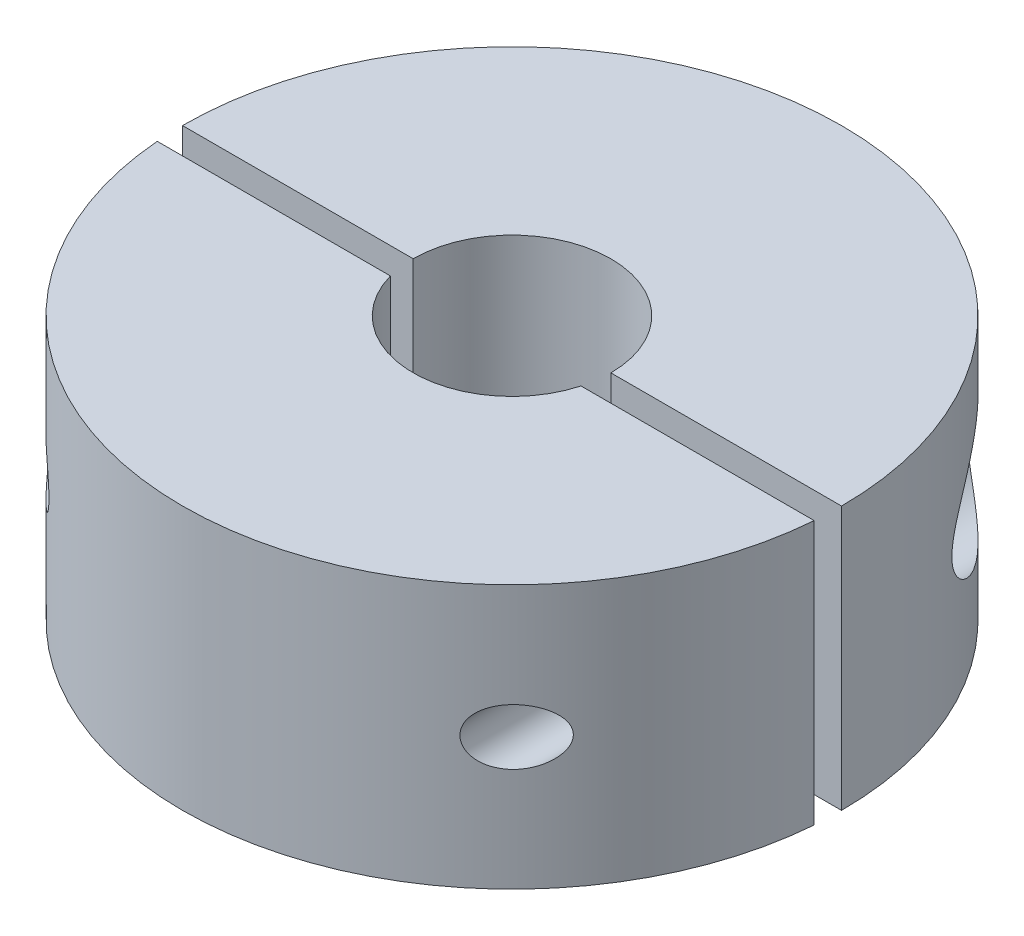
ISO-10303-21;
HEADER;
FILE_DESCRIPTION(('STEP AP214'),'2;1');
FILE_NAME('part.step','',(''),(''),'','','');
FILE_SCHEMA(('AUTOMOTIVE_DESIGN { 1 0 10303 214 1 1 1 1 }'));
ENDSEC;
DATA;
#1=APPLICATION_CONTEXT('core data for automotive mechanical design processes');
#2=APPLICATION_PROTOCOL_DEFINITION('international standard','automotive_design',2000,#1);
#3=PRODUCT_CONTEXT('',#1,'mechanical');
#4=PRODUCT('Part','Part','',(#3));
#5=PRODUCT_RELATED_PRODUCT_CATEGORY('part','',(#4));
#6=PRODUCT_DEFINITION_FORMATION('','',#4);
#7=PRODUCT_DEFINITION_CONTEXT('part definition',#1,'design');
#8=PRODUCT_DEFINITION('design','',#6,#7);
#9=PRODUCT_DEFINITION_SHAPE('','',#8);
#10=(LENGTH_UNIT() NAMED_UNIT(*) SI_UNIT(.MILLI.,.METRE.));
#11=(NAMED_UNIT(*) PLANE_ANGLE_UNIT() SI_UNIT($,.RADIAN.));
#12=(NAMED_UNIT(*) SI_UNIT($,.STERADIAN.) SOLID_ANGLE_UNIT());
#13=UNCERTAINTY_MEASURE_WITH_UNIT(LENGTH_MEASURE(1.E-05),#10,'distance_accuracy_value','');
#14=(GEOMETRIC_REPRESENTATION_CONTEXT(3) GLOBAL_UNCERTAINTY_ASSIGNED_CONTEXT((#13)) GLOBAL_UNIT_ASSIGNED_CONTEXT((#10,
#11,#12)) REPRESENTATION_CONTEXT('',''));
#15=CARTESIAN_POINT('',(0.,0.,0.));
#16=DIRECTION('',(0.,0.,1.));
#17=DIRECTION('',(1.,0.,0.));
#18=AXIS2_PLACEMENT_3D('',#15,#16,#17);
#19=CARTESIAN_POINT('',(0.,12.7,0.));
#20=DIRECTION('',(0.,1.,0.));
#21=DIRECTION('',(0.,0.,1.));
#22=AXIS2_PLACEMENT_3D('',#19,#20,#21);
#23=PLANE('',#22);
#24=DIRECTION('',(1.,0.,0.));
#25=VECTOR('',#24,1.);
#26=CARTESIAN_POINT('',(-21.9078752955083,12.7,1.26662234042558));
#27=LINE('',#26,#25);
#28=CARTESIAN_POINT('',(-15.8243891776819,12.7,1.26662234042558));
#29=VERTEX_POINT('',#28);
#30=CARTESIAN_POINT('',(-4.59097746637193,12.7,1.26662234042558));
#31=VERTEX_POINT('',#30);
#32=EDGE_CURVE('E56',#29,#31,#27,.T.);
#33=ORIENTED_EDGE('',*,*,#32,.F.);
#34=CARTESIAN_POINT('',(0.,12.7,0.));
#35=DIRECTION('',(0.,1.,0.));
#36=DIRECTION('',(0.,0.,1.));
#37=AXIS2_PLACEMENT_3D('',#34,#35,#36);
#38=CIRCLE('',#37,15.875);
#39=CARTESIAN_POINT('',(15.8243891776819,12.7,1.26662234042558));
#40=VERTEX_POINT('',#39);
#41=EDGE_CURVE('E111',#29,#40,#38,.T.);
#42=ORIENTED_EDGE('',*,*,#41,.T.);
#43=CARTESIAN_POINT('',(4.59097746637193,12.7,1.26662234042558));
#44=VERTEX_POINT('',#43);
#45=EDGE_CURVE('E93',#44,#40,#27,.T.);
#46=ORIENTED_EDGE('',*,*,#45,.F.);
#47=CARTESIAN_POINT('',(0.,12.7,0.));
#48=DIRECTION('',(0.,1.,0.));
#49=DIRECTION('',(0.,0.,1.));
#50=AXIS2_PLACEMENT_3D('',#47,#48,#49);
#51=CIRCLE('',#50,4.7625);
#52=EDGE_CURVE('E98',#31,#44,#51,.T.);
#53=ORIENTED_EDGE('',*,*,#52,.F.);
#54=EDGE_LOOP('',(#33,#42,#46,#53));
#55=FACE_BOUND('',#54,.T.);
#56=ADVANCED_FACE('F48',(#55),#23,.T.);
#57=CARTESIAN_POINT('',(0.,0.,0.));
#58=DIRECTION('',(0.,1.,0.));
#59=DIRECTION('',(0.,0.,1.));
#60=AXIS2_PLACEMENT_3D('',#57,#58,#59);
#61=PLANE('',#60);
#62=CARTESIAN_POINT('',(0.,0.,0.));
#63=DIRECTION('',(0.,1.,0.));
#64=DIRECTION('',(0.,0.,1.));
#65=AXIS2_PLACEMENT_3D('',#62,#63,#64);
#66=CIRCLE('',#65,15.875);
#67=CARTESIAN_POINT('',(-15.8243891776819,0.,1.26662234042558));
#68=VERTEX_POINT('',#67);
#69=CARTESIAN_POINT('',(15.8243891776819,0.,1.26662234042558));
#70=VERTEX_POINT('',#69);
#71=EDGE_CURVE('E99',#68,#70,#66,.T.);
#72=ORIENTED_EDGE('',*,*,#71,.F.);
#73=DIRECTION('',(1.,0.,0.));
#74=VECTOR('',#73,1.);
#75=CARTESIAN_POINT('',(-21.9078752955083,0.,1.26662234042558));
#76=LINE('',#75,#74);
#77=CARTESIAN_POINT('',(-4.59097746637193,0.,1.26662234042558));
#78=VERTEX_POINT('',#77);
#79=EDGE_CURVE('E69',#68,#78,#76,.T.);
#80=ORIENTED_EDGE('',*,*,#79,.T.);
#81=CARTESIAN_POINT('',(0.,0.,0.));
#82=DIRECTION('',(0.,1.,0.));
#83=DIRECTION('',(0.,0.,1.));
#84=AXIS2_PLACEMENT_3D('',#81,#82,#83);
#85=CIRCLE('',#84,4.7625);
#86=CARTESIAN_POINT('',(4.59097746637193,0.,1.26662234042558));
#87=VERTEX_POINT('',#86);
#88=EDGE_CURVE('E51',#78,#87,#85,.T.);
#89=ORIENTED_EDGE('',*,*,#88,.T.);
#90=EDGE_CURVE('E88',#87,#70,#76,.T.);
#91=ORIENTED_EDGE('',*,*,#90,.T.);
#92=EDGE_LOOP('',(#72,#80,#89,#91));
#93=FACE_BOUND('',#92,.T.);
#94=ADVANCED_FACE('F104',(#93),#61,.F.);
#95=CARTESIAN_POINT('',(0.,12.7,0.));
#96=DIRECTION('',(0.,-1.,0.));
#97=DIRECTION('',(0.,0.,-1.));
#98=AXIS2_PLACEMENT_3D('',#95,#96,#97);
#99=CYLINDRICAL_SURFACE('',#98,15.875);
#100=CARTESIAN_POINT('',(9.89983917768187,6.35,12.4100285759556));
#101=CARTESIAN_POINT('',(9.89984348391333,6.41360092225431,12.4100256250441));
#102=CARTESIAN_POINT('',(9.90435704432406,6.47724579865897,12.4064286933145));
#103=CARTESIAN_POINT('',(9.92211288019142,6.60253042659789,12.39223236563));
#104=CARTESIAN_POINT('',(9.93536469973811,6.66416790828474,12.3816253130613));
#105=CARTESIAN_POINT('',(9.96965984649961,6.78339226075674,12.3540270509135));
#106=CARTESIAN_POINT('',(9.99066879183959,6.84099569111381,12.3370640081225));
#107=CARTESIAN_POINT('',(10.0393080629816,6.95121470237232,12.2975158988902));
#108=CARTESIAN_POINT('',(10.0669388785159,7.00382991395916,12.2749304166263));
#109=CARTESIAN_POINT('',(10.1295573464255,7.10663612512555,12.2233153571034));
#110=CARTESIAN_POINT('',(10.1649100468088,7.1564382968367,12.1939589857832));
#111=CARTESIAN_POINT('',(10.2402467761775,7.24918635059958,12.1307624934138));
#112=CARTESIAN_POINT('',(10.2802333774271,7.29212839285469,12.0969198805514));
#113=CARTESIAN_POINT('',(10.3848325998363,7.39127205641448,12.0074012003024));
#114=CARTESIAN_POINT('',(10.4516159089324,7.44308940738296,11.9493831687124));
#115=CARTESIAN_POINT('',(10.5895059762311,7.5318338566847,11.8273636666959));
#116=CARTESIAN_POINT('',(10.6606221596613,7.56872705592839,11.763348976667));
#117=CARTESIAN_POINT('',(10.8274234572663,7.63814827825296,11.6102966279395));
#118=CARTESIAN_POINT('',(10.9237935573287,7.66564364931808,11.5197268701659));
#119=CARTESIAN_POINT('',(11.116041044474,7.69920031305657,11.3343360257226));
#120=CARTESIAN_POINT('',(11.2119179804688,7.70524459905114,11.2395116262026));
#121=CARTESIAN_POINT('',(11.4025562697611,7.69763088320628,11.0460904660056));
#122=CARTESIAN_POINT('',(11.4972637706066,7.6836046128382,10.9474563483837));
#123=CARTESIAN_POINT('',(11.6818382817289,7.63610024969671,10.7502792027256));
#124=CARTESIAN_POINT('',(11.7717045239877,7.60261908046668,10.6517361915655));
#125=CARTESIAN_POINT('',(11.9342175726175,7.5212116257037,10.4691538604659));
#126=CARTESIAN_POINT('',(12.0076327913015,7.47552044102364,10.3848011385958));
#127=CARTESIAN_POINT('',(12.1475023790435,7.36781536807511,10.2208278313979));
#128=CARTESIAN_POINT('',(12.2139697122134,7.30583266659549,10.1411985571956));
#129=CARTESIAN_POINT('',(12.313760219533,7.19041543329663,10.0195120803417));
#130=CARTESIAN_POINT('',(12.3501203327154,7.14259355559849,9.97462302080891));
#131=CARTESIAN_POINT('',(12.4178098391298,7.03919923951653,9.89022369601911));
#132=CARTESIAN_POINT('',(12.4491461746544,6.98363769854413,9.85070601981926));
#133=CARTESIAN_POINT('',(12.4983683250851,6.87862371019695,9.78813630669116));
#134=CARTESIAN_POINT('',(12.5176810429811,6.83085480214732,9.7634027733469));
#135=CARTESIAN_POINT('',(12.5512639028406,6.73089675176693,9.72019287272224));
#136=CARTESIAN_POINT('',(12.565541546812,6.67871433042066,9.70170719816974));
#137=CARTESIAN_POINT('',(12.5860990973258,6.57964549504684,9.67501802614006));
#138=CARTESIAN_POINT('',(12.5933005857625,6.53327284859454,9.6656331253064));
#139=CARTESIAN_POINT('',(12.602820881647,6.4391941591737,9.65321681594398));
#140=CARTESIAN_POINT('',(12.6051430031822,6.39148904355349,9.65018109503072));
#141=CARTESIAN_POINT('',(12.6047068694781,6.2960973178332,9.65075073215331));
#142=CARTESIAN_POINT('',(12.6019437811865,6.24841076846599,9.65436240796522));
#143=CARTESIAN_POINT('',(12.5915692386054,6.1544833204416,9.66788905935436));
#144=CARTESIAN_POINT('',(12.5839543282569,6.1082434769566,9.67780852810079));
#145=CARTESIAN_POINT('',(12.5621271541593,6.00763185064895,9.70613066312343));
#146=CARTESIAN_POINT('',(12.5467815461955,5.95391853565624,9.72598350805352));
#147=CARTESIAN_POINT('',(12.5108202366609,5.85128617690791,9.77219827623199));
#148=CARTESIAN_POINT('',(12.4901951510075,5.80237588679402,9.79857178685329));
#149=CARTESIAN_POINT('',(12.4345892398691,5.68862305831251,9.86911444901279));
#150=CARTESIAN_POINT('',(12.3973317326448,5.62656065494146,9.9159413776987));
#151=CARTESIAN_POINT('',(12.3166659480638,5.51237687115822,10.0159631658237));
#152=CARTESIAN_POINT('',(12.2732438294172,5.46027849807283,10.0691723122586));
#153=CARTESIAN_POINT('',(12.1927894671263,5.37657940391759,10.1663410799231));
#154=CARTESIAN_POINT('',(12.1567137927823,5.34305671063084,10.2094681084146));
#155=CARTESIAN_POINT('',(12.0823572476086,5.28093873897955,10.2973584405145));
#156=CARTESIAN_POINT('',(12.0440752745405,5.25234595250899,10.3421225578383));
#157=CARTESIAN_POINT('',(11.9264128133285,5.17355964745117,10.4781015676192));
#158=CARTESIAN_POINT('',(11.8442177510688,5.1303601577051,10.5710007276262));
#159=CARTESIAN_POINT('',(11.6712610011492,5.06044436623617,10.7617155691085));
#160=CARTESIAN_POINT('',(11.5802945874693,5.03439935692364,10.8595857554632));
#161=CARTESIAN_POINT('',(11.3942372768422,5.0016003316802,11.0546421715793));
#162=CARTESIAN_POINT('',(11.2991478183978,4.99483964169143,11.1518286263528));
#163=CARTESIAN_POINT('',(11.1121351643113,5.00167144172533,11.3381013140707));
#164=CARTESIAN_POINT('',(11.0203255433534,5.01416476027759,11.4273390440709));
#165=CARTESIAN_POINT('',(10.8371771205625,5.05931658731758,11.6011667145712));
#166=CARTESIAN_POINT('',(10.7458379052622,5.09195239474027,11.685761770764));
#167=CARTESIAN_POINT('',(10.5900471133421,5.16839685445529,11.8268607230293));
#168=CARTESIAN_POINT('',(10.5246728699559,5.20724227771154,11.8850313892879));
#169=CARTESIAN_POINT('',(10.3984375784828,5.29824349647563,11.9956291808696));
#170=CARTESIAN_POINT('',(10.3375705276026,5.35038116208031,12.0480639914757));
#171=CARTESIAN_POINT('',(10.2351335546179,5.45622496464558,12.1351238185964));
#172=CARTESIAN_POINT('',(10.1921724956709,5.50739103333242,12.1711917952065));
#173=CARTESIAN_POINT('',(10.1128781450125,5.61819986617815,12.2371555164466));
#174=CARTESIAN_POINT('',(10.0765392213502,5.67783534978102,12.267056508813));
#175=CARTESIAN_POINT('',(10.0174013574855,5.79516071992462,12.315378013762));
#176=CARTESIAN_POINT('',(9.99338991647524,5.85180588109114,12.3348469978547));
#177=CARTESIAN_POINT('',(9.95299862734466,5.9694406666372,12.3674622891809));
#178=CARTESIAN_POINT('',(9.93660684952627,6.03042332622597,12.3806184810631));
#179=CARTESIAN_POINT('',(9.9163827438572,6.1347838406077,12.3968174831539));
#180=CARTESIAN_POINT('',(9.91019896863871,6.17743023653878,12.4017583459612));
#181=CARTESIAN_POINT('',(9.90192541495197,6.26337755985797,12.4083651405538));
#182=CARTESIAN_POINT('',(9.89983624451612,6.30667858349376,12.4100305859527));
#183=CARTESIAN_POINT('',(9.89983917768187,6.35,12.4100285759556));
#184=B_SPLINE_CURVE_WITH_KNOTS('',3,(#100,#101,#102,#103,#104,#105,#106,#107,#108,#109,#110,
#111,#112,#113,#114,#115,#116,#117,#118,#119,#120,#121,#122,#123,#124,#125,#126,#127,#128,#129,
#130,#131,#132,#133,#134,#135,#136,#137,#138,#139,#140,#141,#142,#143,#144,#145,#146,#147,#148,
#149,#150,#151,#152,#153,#154,#155,#156,#157,#158,#159,#160,#161,#162,#163,#164,#165,#166,#167,
#168,#169,#170,#171,#172,#173,#174,#175,#176,#177,#178,#179,#180,#181,#182,#183),.UNSPECIFIED.,
.T.,.F.,(4,2,2,2,2,2,2,2,2,2,2,2,2,2,2,2,2,2,2,2,2,2,2,2,2,2,2,2,2,2,2,2,2,2,2,2,2,2,2,2,2,4),
(0.,0.190625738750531,0.381460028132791,0.571458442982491,0.761470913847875,0.964016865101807,
1.16667579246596,1.47254085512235,1.77909681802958,2.18218341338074,2.58558950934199,
2.9964931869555,3.40746185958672,3.76875721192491,4.12936591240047,4.35378200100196,
4.5778852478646,4.74875921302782,4.91937749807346,5.06232265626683,5.2051706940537,
5.34815456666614,5.49124040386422,5.66811780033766,5.84531180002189,6.10252816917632,
6.36033147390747,6.5564581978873,6.75268376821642,7.14514579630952,7.5521742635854,
7.95906184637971,8.34356651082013,8.72763861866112,9.01388269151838,9.29973841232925,
9.52665269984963,9.7533730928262,9.9461599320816,10.1386439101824,10.2684683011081,
10.398311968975),.UNSPECIFIED.);
#185=CARTESIAN_POINT('',(9.89983917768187,6.35,12.4100285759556));
#186=VERTEX_POINT('',#185);
#187=EDGE_CURVE('E207',#186,#186,#184,.T.);
#188=ORIENTED_EDGE('',*,*,#187,.T.);
#189=EDGE_LOOP('',(#188));
#190=FACE_BOUND('',#189,.T.);
#191=CARTESIAN_POINT('',(-12.6049391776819,6.35,9.65044731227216));
#192=CARTESIAN_POINT('',(-12.6049385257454,6.40630066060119,9.65044824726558));
#193=CARTESIAN_POINT('',(-12.6013859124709,6.46260501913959,9.65509369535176));
#194=CARTESIAN_POINT('',(-12.5875964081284,6.57297673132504,9.67306373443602));
#195=CARTESIAN_POINT('',(-12.5773503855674,6.62704092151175,9.6864001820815));
#196=CARTESIAN_POINT('',(-12.5513289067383,6.73076608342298,9.72009299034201));
#197=CARTESIAN_POINT('',(-12.5356131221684,6.78046760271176,9.7403735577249));
#198=CARTESIAN_POINT('',(-12.4997233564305,6.87548302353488,9.78638826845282));
#199=CARTESIAN_POINT('',(-12.4795474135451,6.92079498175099,9.81212481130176));
#200=CARTESIAN_POINT('',(-12.4228742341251,7.03207068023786,9.88387223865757));
#201=CARTESIAN_POINT('',(-12.3837170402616,7.09468331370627,9.93295850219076));
#202=CARTESIAN_POINT('',(-12.2991337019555,7.20955070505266,10.0375041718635));
#203=CARTESIAN_POINT('',(-12.2536894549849,7.26177445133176,10.0929819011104));
#204=CARTESIAN_POINT('',(-12.1698627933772,7.34509442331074,10.1937852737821));
#205=CARTESIAN_POINT('',(-12.1324706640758,7.37823431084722,10.2382763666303));
#206=CARTESIAN_POINT('',(-12.0554737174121,7.43943377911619,10.3288295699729));
#207=CARTESIAN_POINT('',(-12.01586781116,7.46749083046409,10.3748924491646));
#208=CARTESIAN_POINT('',(-11.8942317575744,7.54442510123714,10.5146596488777));
#209=CARTESIAN_POINT('',(-11.8093733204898,7.58607498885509,10.6099545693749));
#210=CARTESIAN_POINT('',(-11.6312499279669,7.65198929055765,10.8049865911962));
#211=CARTESIAN_POINT('',(-11.5377966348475,7.6756097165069,10.9047640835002));
#212=CARTESIAN_POINT('',(-11.3469084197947,7.70267737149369,11.1032520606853));
#213=CARTESIAN_POINT('',(-11.2494754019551,7.706134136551,11.201963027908));
#214=CARTESIAN_POINT('',(-11.0623184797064,7.69208983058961,11.3866740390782));
#215=CARTESIAN_POINT('',(-10.9727546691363,7.67657295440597,11.4729833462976));
#216=CARTESIAN_POINT('',(-10.7945448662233,7.62605860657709,11.6408041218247));
#217=CARTESIAN_POINT('',(-10.7058979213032,7.59108398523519,11.7223210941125));
#218=CARTESIAN_POINT('',(-10.5548385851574,7.51110827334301,11.8582726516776));
#219=CARTESIAN_POINT('',(-10.491426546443,7.47082783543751,11.9143689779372));
#220=CARTESIAN_POINT('',(-10.3693607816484,7.3773945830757,12.0207527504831));
#221=CARTESIAN_POINT('',(-10.3107002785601,7.32426054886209,12.0710485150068));
#222=CARTESIAN_POINT('',(-10.2122044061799,7.2169382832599,12.1544150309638));
#223=CARTESIAN_POINT('',(-10.1709647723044,7.16515318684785,12.188909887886));
#224=CARTESIAN_POINT('',(-10.0952058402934,7.05346506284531,12.2517289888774));
#225=CARTESIAN_POINT('',(-10.0606847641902,6.99356419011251,12.2800548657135));
#226=CARTESIAN_POINT('',(-10.000144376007,6.86603856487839,12.3294074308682));
#227=CARTESIAN_POINT('',(-9.9742028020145,6.79835029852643,12.3503674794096));
#228=CARTESIAN_POINT('',(-9.93327116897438,6.65767614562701,12.3833136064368));
#229=CARTESIAN_POINT('',(-9.91826901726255,6.58469620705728,12.3953095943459));
#230=CARTESIAN_POINT('',(-9.90184139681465,6.44733173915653,12.4084346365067));
#231=CARTESIAN_POINT('',(-9.89873687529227,6.38327124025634,12.4109078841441));
#232=CARTESIAN_POINT('',(-9.901634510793,6.25550001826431,12.4085964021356));
#233=CARTESIAN_POINT('',(-9.90763332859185,6.1917891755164,12.403814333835));
#234=CARTESIAN_POINT('',(-9.92762670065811,6.07088439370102,12.3878165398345));
#235=CARTESIAN_POINT('',(-9.94106913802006,6.01353749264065,12.3770448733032));
#236=CARTESIAN_POINT('',(-9.97476213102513,5.90229479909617,12.3499073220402));
#237=CARTESIAN_POINT('',(-9.99501326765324,5.848399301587,12.3335409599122));
#238=CARTESIAN_POINT('',(-10.0428379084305,5.74171341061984,12.2946344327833));
#239=CARTESIAN_POINT('',(-10.070800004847,5.68921945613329,12.2717636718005));
#240=CARTESIAN_POINT('',(-10.1320491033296,5.58997522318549,12.2212432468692));
#241=CARTESIAN_POINT('',(-10.1653393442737,5.54322846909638,12.1935906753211));
#242=CARTESIAN_POINT('',(-10.2514389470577,5.4367667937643,12.1213851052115));
#243=CARTESIAN_POINT('',(-10.306441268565,5.38025200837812,12.0747118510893));
#244=CARTESIAN_POINT('',(-10.4219406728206,5.27965439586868,11.9751671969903));
#245=CARTESIAN_POINT('',(-10.4824484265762,5.23559642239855,11.922283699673));
#246=CARTESIAN_POINT('',(-10.6264483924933,5.14715961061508,11.7943274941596));
#247=CARTESIAN_POINT('',(-10.711116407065,5.10715986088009,11.717557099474));
#248=CARTESIAN_POINT('',(-10.8822253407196,5.04591074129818,11.5588277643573));
#249=CARTESIAN_POINT('',(-10.968668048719,5.02468134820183,11.4768633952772));
#250=CARTESIAN_POINT('',(-11.1628554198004,4.99600150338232,11.2884409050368));
#251=CARTESIAN_POINT('',(-11.2704201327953,4.99343540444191,11.1810597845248));
#252=CARTESIAN_POINT('',(-11.4815256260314,5.0127801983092,10.9641759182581));
#253=CARTESIAN_POINT('',(-11.5850573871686,5.03474302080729,10.8546691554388));
#254=CARTESIAN_POINT('',(-11.735673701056,5.08561739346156,10.6908935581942));
#255=CARTESIAN_POINT('',(-11.7853290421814,5.10570619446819,10.6361169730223));
#256=CARTESIAN_POINT('',(-11.8826228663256,5.15204211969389,10.5273079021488));
#257=CARTESIAN_POINT('',(-11.9302606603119,5.17829132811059,10.4732756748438));
#258=CARTESIAN_POINT('',(-12.0229421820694,5.23705715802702,10.3667476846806));
#259=CARTESIAN_POINT('',(-12.0679937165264,5.26955347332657,10.3142475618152));
#260=CARTESIAN_POINT('',(-12.1551166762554,5.34121197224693,10.211429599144));
#261=CARTESIAN_POINT('',(-12.1971909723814,5.38036760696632,10.1611096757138));
#262=CARTESIAN_POINT('',(-12.2772547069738,5.46545414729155,10.0642212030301));
#263=CARTESIAN_POINT('',(-12.3152821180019,5.51131025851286,10.0176190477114));
#264=CARTESIAN_POINT('',(-12.3866564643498,5.61069957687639,9.92922858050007));
#265=CARTESIAN_POINT('',(-12.4200090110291,5.66422342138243,9.88743450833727));
#266=CARTESIAN_POINT('',(-12.4744276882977,5.76799620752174,9.81864604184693));
#267=CARTESIAN_POINT('',(-12.4966184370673,5.81678494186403,9.79036082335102));
#268=CARTESIAN_POINT('',(-12.5357799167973,5.91952258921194,9.74016739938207));
#269=CARTESIAN_POINT('',(-12.5527561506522,5.97346598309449,9.71825247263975));
#270=CARTESIAN_POINT('',(-12.5788430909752,6.08046288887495,9.68445925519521));
#271=CARTESIAN_POINT('',(-12.5885389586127,6.13313164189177,9.67183647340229));
#272=CARTESIAN_POINT('',(-12.6015833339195,6.2405342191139,9.65483522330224));
#273=CARTESIAN_POINT('',(-12.6049398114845,6.29526536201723,9.65044640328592));
#274=CARTESIAN_POINT('',(-12.6049391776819,6.35,9.65044731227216));
#275=B_SPLINE_CURVE_WITH_KNOTS('',3,(#191,#192,#193,#194,#195,#196,#197,#198,#199,#200,#201,
#202,#203,#204,#205,#206,#207,#208,#209,#210,#211,#212,#213,#214,#215,#216,#217,#218,#219,#220,
#221,#222,#223,#224,#225,#226,#227,#228,#229,#230,#231,#232,#233,#234,#235,#236,#237,#238,#239,
#240,#241,#242,#243,#244,#245,#246,#247,#248,#249,#250,#251,#252,#253,#254,#255,#256,#257,#258,
#259,#260,#261,#262,#263,#264,#265,#266,#267,#268,#269,#270,#271,#272,#273,#274),.UNSPECIFIED.,
.T.,.F.,(4,2,2,2,2,2,2,2,2,2,2,2,2,2,2,2,2,2,2,2,2,2,2,2,2,2,2,2,2,2,2,2,2,2,2,2,2,2,2,2,2,4),
(0.,0.168629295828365,0.337489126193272,0.504561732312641,0.671707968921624,0.936248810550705,
1.20156785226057,1.40201227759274,1.60255617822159,2.00358969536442,2.41835222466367,
2.83291858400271,3.20760281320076,3.58184795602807,3.86214979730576,4.14204454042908,
4.36512643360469,4.58814921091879,4.81314069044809,5.03788308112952,5.22940513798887,
5.42085695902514,5.5997107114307,5.77857972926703,5.96900667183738,6.15954981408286,
6.43294918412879,6.70689024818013,7.06819939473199,7.42989261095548,7.88367469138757,
8.33841928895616,8.56803855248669,8.79773561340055,9.02669829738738,9.25543710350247,
9.48179411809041,9.70787706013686,9.88906599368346,10.0700630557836,10.2342083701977,
10.3981471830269),.UNSPECIFIED.);
#276=CARTESIAN_POINT('',(-12.6049391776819,6.35,9.65044731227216));
#277=VERTEX_POINT('',#276);
#278=EDGE_CURVE('E119',#277,#277,#275,.T.);
#279=ORIENTED_EDGE('',*,*,#278,.T.);
#280=EDGE_LOOP('',(#279));
#281=FACE_BOUND('',#280,.T.);
#282=ORIENTED_EDGE('',*,*,#41,.F.);
#283=DIRECTION('',(0.,-1.,0.));
#284=VECTOR('',#283,1.);
#285=CARTESIAN_POINT('',(-15.8243891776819,12.7,1.26662234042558));
#286=LINE('',#285,#284);
#287=EDGE_CURVE('E64',#29,#68,#286,.T.);
#288=ORIENTED_EDGE('',*,*,#287,.T.);
#289=ORIENTED_EDGE('',*,*,#71,.T.);
#290=DIRECTION('',(0.,-1.,0.));
#291=VECTOR('',#290,1.);
#292=CARTESIAN_POINT('',(15.8243891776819,12.7,1.26662234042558));
#293=LINE('',#292,#291);
#294=EDGE_CURVE('E91',#70,#40,#293,.F.);
#295=ORIENTED_EDGE('',*,*,#294,.T.);
#296=EDGE_LOOP('',(#282,#288,#289,#295));
#297=FACE_BOUND('',#296,.T.);
#298=ADVANCED_FACE('F107',(#190,#281,#297),#99,.T.);
#299=CARTESIAN_POINT('',(0.,12.7,0.));
#300=DIRECTION('',(0.,-1.,0.));
#301=DIRECTION('',(0.,0.,-1.));
#302=AXIS2_PLACEMENT_3D('',#299,#300,#301);
#303=CYLINDRICAL_SURFACE('',#302,4.7625);
#304=DIRECTION('',(0.,-1.,0.));
#305=VECTOR('',#304,1.);
#306=CARTESIAN_POINT('',(-4.59097746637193,12.7,1.26662234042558));
#307=LINE('',#306,#305);
#308=EDGE_CURVE('E12',#31,#78,#307,.T.);
#309=ORIENTED_EDGE('',*,*,#308,.F.);
#310=ORIENTED_EDGE('',*,*,#52,.T.);
#311=DIRECTION('',(0.,-1.,0.));
#312=VECTOR('',#311,1.);
#313=CARTESIAN_POINT('',(4.59097746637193,12.7,1.26662234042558));
#314=LINE('',#313,#312);
#315=EDGE_CURVE('E83',#87,#44,#314,.F.);
#316=ORIENTED_EDGE('',*,*,#315,.F.);
#317=ORIENTED_EDGE('',*,*,#88,.F.);
#318=EDGE_LOOP('',(#309,#310,#316,#317));
#319=FACE_BOUND('',#318,.T.);
#320=ADVANCED_FACE('F141',(#319),#303,.F.);
#321=CARTESIAN_POINT('',(-21.9078752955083,0.,1.26662234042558));
#322=DIRECTION('',(0.,0.,1.));
#323=DIRECTION('',(1.,0.,0.));
#324=AXIS2_PLACEMENT_3D('',#321,#322,#323);
#325=PLANE('',#324);
#326=CARTESIAN_POINT('',(11.2523891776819,6.35,1.26662234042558));
#327=DIRECTION('',(0.,0.,-1.));
#328=DIRECTION('',(-1.,0.,0.));
#329=AXIS2_PLACEMENT_3D('',#326,#327,#328);
#330=CIRCLE('',#329,1.35255);
#331=CARTESIAN_POINT('',(9.89983917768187,6.35,1.26662234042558));
#332=VERTEX_POINT('',#331);
#333=EDGE_CURVE('E204',#332,#332,#330,.T.);
#334=ORIENTED_EDGE('',*,*,#333,.F.);
#335=EDGE_LOOP('',(#334));
#336=FACE_BOUND('',#335,.T.);
#337=ORIENTED_EDGE('',*,*,#90,.F.);
#338=ORIENTED_EDGE('',*,*,#315,.T.);
#339=ORIENTED_EDGE('',*,*,#45,.T.);
#340=ORIENTED_EDGE('',*,*,#294,.F.);
#341=EDGE_LOOP('',(#337,#338,#339,#340));
#342=FACE_BOUND('',#341,.T.);
#343=ADVANCED_FACE('F92',(#336,#342),#325,.F.);
#344=CARTESIAN_POINT('',(-11.2523891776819,6.35,1.26662234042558));
#345=DIRECTION('',(0.,0.,-1.));
#346=DIRECTION('',(-1.,0.,0.));
#347=AXIS2_PLACEMENT_3D('',#344,#345,#346);
#348=CIRCLE('',#347,1.35255);
#349=CARTESIAN_POINT('',(-12.6049391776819,6.35,1.26662234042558));
#350=VERTEX_POINT('',#349);
#351=EDGE_CURVE('E126',#350,#350,#348,.T.);
#352=ORIENTED_EDGE('',*,*,#351,.F.);
#353=EDGE_LOOP('',(#352));
#354=FACE_BOUND('',#353,.T.);
#355=ORIENTED_EDGE('',*,*,#32,.T.);
#356=ORIENTED_EDGE('',*,*,#308,.T.);
#357=ORIENTED_EDGE('',*,*,#79,.F.);
#358=ORIENTED_EDGE('',*,*,#287,.F.);
#359=EDGE_LOOP('',(#355,#356,#357,#358));
#360=FACE_BOUND('',#359,.T.);
#361=ADVANCED_FACE('F136',(#354,#360),#325,.F.);
#362=CARTESIAN_POINT('',(-11.2523891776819,6.35,1.26662234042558));
#363=DIRECTION('',(0.,0.,-1.));
#364=DIRECTION('',(-1.,0.,0.));
#365=AXIS2_PLACEMENT_3D('',#362,#363,#364);
#366=CYLINDRICAL_SURFACE('',#365,1.35255);
#367=ORIENTED_EDGE('',*,*,#351,.T.);
#368=EDGE_LOOP('',(#367));
#369=FACE_BOUND('',#368,.T.);
#370=ORIENTED_EDGE('',*,*,#278,.F.);
#371=EDGE_LOOP('',(#370));
#372=FACE_BOUND('',#371,.T.);
#373=ADVANCED_FACE('F130',(#369,#372),#366,.F.);
#374=CARTESIAN_POINT('',(11.2523891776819,6.35,1.26662234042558));
#375=DIRECTION('',(0.,0.,-1.));
#376=DIRECTION('',(-1.,0.,0.));
#377=AXIS2_PLACEMENT_3D('',#374,#375,#376);
#378=CYLINDRICAL_SURFACE('',#377,1.35255);
#379=ORIENTED_EDGE('',*,*,#333,.T.);
#380=EDGE_LOOP('',(#379));
#381=FACE_BOUND('',#380,.T.);
#382=ORIENTED_EDGE('',*,*,#187,.F.);
#383=EDGE_LOOP('',(#382));
#384=FACE_BOUND('',#383,.T.);
#385=ADVANCED_FACE('F135',(#381,#384),#378,.F.);
#386=CLOSED_SHELL('',(#56,#94,#298,#320,#343,#361,#373,#385));
#387=MANIFOLD_SOLID_BREP('B2',#386);
#388=CARTESIAN_POINT('',(0.,12.7,0.));
#389=DIRECTION('',(0.,-1.,0.));
#390=DIRECTION('',(0.,0.,-1.));
#391=AXIS2_PLACEMENT_3D('',#388,#389,#390);
#392=CYLINDRICAL_SURFACE('',#391,4.7625);
#393=DIRECTION('',(0.,-1.,0.));
#394=VECTOR('',#393,1.);
#395=CARTESIAN_POINT('',(4.7625,12.7,0.));
#396=LINE('',#395,#394);
#397=CARTESIAN_POINT('',(4.7625,12.7,0.));
#398=VERTEX_POINT('',#397);
#399=CARTESIAN_POINT('',(4.7625,0.,0.));
#400=VERTEX_POINT('',#399);
#401=EDGE_CURVE('E46',#398,#400,#396,.T.);
#402=ORIENTED_EDGE('',*,*,#401,.F.);
#403=CARTESIAN_POINT('',(0.,12.7,0.));
#404=DIRECTION('',(0.,1.,0.));
#405=DIRECTION('',(0.,0.,1.));
#406=AXIS2_PLACEMENT_3D('',#403,#404,#405);
#407=CIRCLE('',#406,4.7625);
#408=CARTESIAN_POINT('',(-4.7625,12.7,0.));
#409=VERTEX_POINT('',#408);
#410=EDGE_CURVE('E301',#398,#409,#407,.T.);
#411=ORIENTED_EDGE('',*,*,#410,.T.);
#412=DIRECTION('',(0.,-1.,0.));
#413=VECTOR('',#412,1.);
#414=CARTESIAN_POINT('',(-4.7625,12.7,0.));
#415=LINE('',#414,#413);
#416=CARTESIAN_POINT('',(-4.7625,0.,0.));
#417=VERTEX_POINT('',#416);
#418=EDGE_CURVE('E252',#417,#409,#415,.F.);
#419=ORIENTED_EDGE('',*,*,#418,.F.);
#420=CARTESIAN_POINT('',(0.,0.,0.));
#421=DIRECTION('',(0.,1.,0.));
#422=DIRECTION('',(0.,0.,1.));
#423=AXIS2_PLACEMENT_3D('',#420,#421,#422);
#424=CIRCLE('',#423,4.7625);
#425=EDGE_CURVE('E291',#400,#417,#424,.T.);
#426=ORIENTED_EDGE('',*,*,#425,.F.);
#427=EDGE_LOOP('',(#402,#411,#419,#426));
#428=FACE_BOUND('',#427,.T.);
#429=ADVANCED_FACE('F239',(#428),#392,.F.);
#430=CARTESIAN_POINT('',(0.,12.7,0.));
#431=DIRECTION('',(0.,-1.,0.));
#432=DIRECTION('',(0.,0.,-1.));
#433=AXIS2_PLACEMENT_3D('',#430,#431,#432);
#434=CYLINDRICAL_SURFACE('',#433,15.875);
#435=CARTESIAN_POINT('',(-8.20438917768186,6.35,-13.590571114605));
#436=CARTESIAN_POINT('',(-8.20439077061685,6.42558126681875,-13.5905704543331));
#437=CARTESIAN_POINT('',(-8.2072070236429,6.5011851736,-13.5888715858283));
#438=CARTESIAN_POINT('',(-8.2184278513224,6.65183862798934,-13.5820875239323));
#439=CARTESIAN_POINT('',(-8.22683581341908,6.72688781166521,-13.5770002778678));
#440=CARTESIAN_POINT('',(-8.26036372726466,6.95066010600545,-13.5566501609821));
#441=CARTESIAN_POINT('',(-8.29378735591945,7.09779658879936,-13.5362989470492));
#442=CARTESIAN_POINT('',(-8.38084132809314,7.38281305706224,-13.4825696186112));
#443=CARTESIAN_POINT('',(-8.43441028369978,7.52071967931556,-13.4492310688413));
#444=CARTESIAN_POINT('',(-8.55906995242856,7.78443080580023,-13.3702418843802));
#445=CARTESIAN_POINT('',(-8.63015236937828,7.91024100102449,-13.3245970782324));
#446=CARTESIAN_POINT('',(-8.78962538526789,8.1519033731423,-13.2199664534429));
#447=CARTESIAN_POINT('',(-8.87857107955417,8.2671954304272,-13.1605395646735));
#448=CARTESIAN_POINT('',(-9.06812387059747,8.48065482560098,-13.0306543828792));
#449=CARTESIAN_POINT('',(-9.16873563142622,8.57881527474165,-12.9601916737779));
#450=CARTESIAN_POINT('',(-9.39096348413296,8.76853414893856,-12.8002492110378));
#451=CARTESIAN_POINT('',(-9.5136375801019,8.85776832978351,-12.7094949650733));
#452=CARTESIAN_POINT('',(-9.76470444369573,9.01439994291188,-12.5176338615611));
#453=CARTESIAN_POINT('',(-9.89310123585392,9.08178172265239,-12.4165196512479));
#454=CARTESIAN_POINT('',(-10.1194259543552,9.18159449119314,-12.2322730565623));
#455=CARTESIAN_POINT('',(-10.216916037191,9.21855288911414,-12.1509940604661));
#456=CARTESIAN_POINT('',(-10.4119135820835,9.28162231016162,-11.9843304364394));
#457=CARTESIAN_POINT('',(-10.5094210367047,9.3077292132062,-11.898944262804));
#458=CARTESIAN_POINT('',(-10.8007581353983,9.37090374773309,-11.6373152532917));
#459=CARTESIAN_POINT('',(-10.9932513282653,9.39276204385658,-11.4557243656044));
#460=CARTESIAN_POINT('',(-11.3068348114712,9.4001140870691,-11.144630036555));
#461=CARTESIAN_POINT('',(-11.4305202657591,9.39522984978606,-11.0177194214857));
#462=CARTESIAN_POINT('',(-11.6729998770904,9.37129504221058,-10.7604774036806));
#463=CARTESIAN_POINT('',(-11.7917922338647,9.352239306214,-10.6301447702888));
#464=CARTESIAN_POINT('',(-12.0239889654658,9.30112005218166,-10.3667851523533));
#465=CARTESIAN_POINT('',(-12.1373809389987,9.26902806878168,-10.2337528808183));
#466=CARTESIAN_POINT('',(-12.358061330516,9.19278355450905,-9.96614335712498));
#467=CARTESIAN_POINT('',(-12.4653506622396,9.1486328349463,-9.83156633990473));
#468=CARTESIAN_POINT('',(-12.6760224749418,9.04769246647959,-9.55847939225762));
#469=CARTESIAN_POINT('',(-12.7792497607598,8.99062534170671,-9.41995248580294));
#470=CARTESIAN_POINT('',(-12.9787434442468,8.86474168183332,-9.1431368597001));
#471=CARTESIAN_POINT('',(-13.075007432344,8.79592110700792,-9.00484823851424));
#472=CARTESIAN_POINT('',(-13.2598706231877,8.64660484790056,-8.73033425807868));
#473=CARTESIAN_POINT('',(-13.3484968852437,8.56615333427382,-8.59410315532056));
#474=CARTESIAN_POINT('',(-13.5179575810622,8.39260205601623,-8.32500215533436));
#475=CARTESIAN_POINT('',(-13.5987987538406,8.2995134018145,-8.1921294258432));
#476=CARTESIAN_POINT('',(-13.7326590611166,8.12411316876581,-7.96507741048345));
#477=CARTESIAN_POINT('',(-13.7875642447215,8.04497306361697,-7.86956641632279));
#478=CARTESIAN_POINT('',(-13.8920099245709,7.87724733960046,-7.68368641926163));
#479=CARTESIAN_POINT('',(-13.9415439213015,7.7886505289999,-7.59332370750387));
#480=CARTESIAN_POINT('',(-14.0345098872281,7.59953892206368,-7.42010074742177));
#481=CARTESIAN_POINT('',(-14.0778788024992,7.49891800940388,-7.33732073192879));
#482=CARTESIAN_POINT('',(-14.1558323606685,7.28447952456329,-7.18576620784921));
#483=CARTESIAN_POINT('',(-14.1904437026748,7.17070364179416,-7.11694926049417));
#484=CARTESIAN_POINT('',(-14.2361088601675,6.97713960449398,-7.02498135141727));
#485=CARTESIAN_POINT('',(-14.2510607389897,6.90177914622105,-6.99454536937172));
#486=CARTESIAN_POINT('',(-14.2754815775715,6.74668005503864,-6.9445680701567));
#487=CARTESIAN_POINT('',(-14.2849586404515,6.66694808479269,-6.92501065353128));
#488=CARTESIAN_POINT('',(-14.2975915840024,6.50412015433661,-6.89889338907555));
#489=CARTESIAN_POINT('',(-14.3006937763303,6.42100158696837,-6.89244393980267));
#490=CARTESIAN_POINT('',(-14.3000369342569,6.25489690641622,-6.8938065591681));
#491=CARTESIAN_POINT('',(-14.2962769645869,6.17191081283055,-6.90162057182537));
#492=CARTESIAN_POINT('',(-14.2829981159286,6.01646608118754,-6.9290533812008));
#493=CARTESIAN_POINT('',(-14.2740444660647,5.94374397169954,-6.94751264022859));
#494=CARTESIAN_POINT('',(-14.2515817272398,5.80199855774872,-6.99347549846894));
#495=CARTESIAN_POINT('',(-14.2380701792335,5.73297727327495,-7.02098397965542));
#496=CARTESIAN_POINT('',(-14.1963261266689,5.55166537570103,-7.10516795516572));
#497=CARTESIAN_POINT('',(-14.1644507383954,5.44342047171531,-7.16868982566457));
#498=CARTESIAN_POINT('',(-14.0926522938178,5.23866543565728,-7.30883166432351));
#499=CARTESIAN_POINT('',(-14.052700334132,5.14219950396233,-7.38549851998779));
#500=CARTESIAN_POINT('',(-13.9691639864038,4.96492235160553,-7.54224901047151));
#501=CARTESIAN_POINT('',(-13.9259311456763,4.88352424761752,-7.62186692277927));
#502=CARTESIAN_POINT('',(-13.8348573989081,4.72850345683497,-7.78595964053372));
#503=CARTESIAN_POINT('',(-13.7870124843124,4.65488765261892,-7.87043864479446));
#504=CARTESIAN_POINT('',(-13.6871941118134,4.51439018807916,-8.04277825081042));
#505=CARTESIAN_POINT('',(-13.6352130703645,4.44752143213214,-8.13064490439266));
#506=CARTESIAN_POINT('',(-13.5275277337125,4.31997277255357,-8.30857685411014));
#507=CARTESIAN_POINT('',(-13.4718223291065,4.25929472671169,-8.39864280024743));
#508=CARTESIAN_POINT('',(-13.3209057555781,4.10742330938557,-8.63710542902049));
#509=CARTESIAN_POINT('',(-13.222810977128,4.02093174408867,-8.78669117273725));
#510=CARTESIAN_POINT('',(-13.0179342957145,3.86203938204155,-9.08747419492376));
#511=CARTESIAN_POINT('',(-12.91114727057,3.78964698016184,-9.23867237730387));
#512=CARTESIAN_POINT('',(-12.689350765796,3.65890220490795,-9.54102411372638));
#513=CARTESIAN_POINT('',(-12.5743441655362,3.60054494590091,-9.69217766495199));
#514=CARTESIAN_POINT('',(-12.336496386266,3.49837652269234,-9.99316010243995));
#515=CARTESIAN_POINT('',(-12.2136584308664,3.45455941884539,-10.1429895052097));
#516=CARTESIAN_POINT('',(-11.9854135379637,3.38956729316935,-10.4110580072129));
#517=CARTESIAN_POINT('',(-11.8813037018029,3.36563865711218,-10.529737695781));
#518=CARTESIAN_POINT('',(-11.6686898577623,3.32863564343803,-10.7648696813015));
#519=CARTESIAN_POINT('',(-11.5601857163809,3.31556159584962,-10.881321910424));
#520=CARTESIAN_POINT('',(-11.3394890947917,3.30124246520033,-11.1111175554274));
#521=CARTESIAN_POINT('',(-11.2273026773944,3.29997882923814,-11.2244655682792));
#522=CARTESIAN_POINT('',(-10.9999063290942,3.31034373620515,-11.4474042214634));
#523=CARTESIAN_POINT('',(-10.8846973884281,3.32196810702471,-11.5569960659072));
#524=CARTESIAN_POINT('',(-10.5966630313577,3.36829071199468,-11.8228934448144));
#525=CARTESIAN_POINT('',(-10.4225831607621,3.41135378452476,-11.9765292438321));
#526=CARTESIAN_POINT('',(-10.075187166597,3.53250732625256,-12.2702006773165));
#527=CARTESIAN_POINT('',(-9.9018703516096,3.6105529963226,-12.4102534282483));
#528=CARTESIAN_POINT('',(-9.59594787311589,3.78653881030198,-12.647664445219));
#529=CARTESIAN_POINT('',(-9.4619103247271,3.87779082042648,-12.7480590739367));
#530=CARTESIAN_POINT('',(-9.26908079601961,4.03404229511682,-12.8882172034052));
#531=CARTESIAN_POINT('',(-9.20615167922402,4.08938128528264,-12.9332136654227));
#532=CARTESIAN_POINT('',(-9.08380234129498,4.20647613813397,-13.0194371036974));
#533=CARTESIAN_POINT('',(-9.02438054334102,4.26822908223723,-13.0606657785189));
#534=CARTESIAN_POINT('',(-8.90935752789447,4.39855789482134,-13.1394017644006));
#535=CARTESIAN_POINT('',(-8.85379335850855,4.46718763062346,-13.1768742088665));
#536=CARTESIAN_POINT('',(-8.74793722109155,4.61047355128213,-13.2473870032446));
#537=CARTESIAN_POINT('',(-8.69764251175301,4.6851265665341,-13.2804296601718));
#538=CARTESIAN_POINT('',(-8.60313161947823,4.84004177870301,-13.3418488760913));
#539=CARTESIAN_POINT('',(-8.55891745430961,4.92030582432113,-13.3702238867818));
#540=CARTESIAN_POINT('',(-8.47740454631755,5.08577489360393,-13.4220554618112));
#541=CARTESIAN_POINT('',(-8.44010425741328,5.17097880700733,-13.4455131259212));
#542=CARTESIAN_POINT('',(-8.37783614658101,5.33328422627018,-13.4843849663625));
#543=CARTESIAN_POINT('',(-8.35187238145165,5.40984601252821,-13.5004658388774));
#544=CARTESIAN_POINT('',(-8.30597461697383,5.56544830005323,-13.5287523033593));
#545=CARTESIAN_POINT('',(-8.28603967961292,5.64448841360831,-13.5409584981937));
#546=CARTESIAN_POINT('',(-8.25255458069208,5.80416695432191,-13.561391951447));
#547=CARTESIAN_POINT('',(-8.23898595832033,5.88480004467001,-13.5696307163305));
#548=CARTESIAN_POINT('',(-8.21836899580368,6.04715945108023,-13.5821273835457));
#549=CARTESIAN_POINT('',(-8.21131614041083,6.12888497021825,-13.5863880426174));
#550=CARTESIAN_POINT('',(-8.20544930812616,6.25715225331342,-13.5899311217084));
#551=CARTESIAN_POINT('',(-8.20438819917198,6.30357185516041,-13.5905715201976));
#552=CARTESIAN_POINT('',(-8.20438917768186,6.35,-13.590571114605));
#553=B_SPLINE_CURVE_WITH_KNOTS('',3,(#435,#436,#437,#438,#439,#440,#441,#442,#443,#444,#445,
#446,#447,#448,#449,#450,#451,#452,#453,#454,#455,#456,#457,#458,#459,#460,#461,#462,#463,#464,
#465,#466,#467,#468,#469,#470,#471,#472,#473,#474,#475,#476,#477,#478,#479,#480,#481,#482,#483,
#484,#485,#486,#487,#488,#489,#490,#491,#492,#493,#494,#495,#496,#497,#498,#499,#500,#501,#502,
#503,#504,#505,#506,#507,#508,#509,#510,#511,#512,#513,#514,#515,#516,#517,#518,#519,#520,#521,
#522,#523,#524,#525,#526,#527,#528,#529,#530,#531,#532,#533,#534,#535,#536,#537,#538,#539,#540,
#541,#542,#543,#544,#545,#546,#547,#548,#549,#550,#551,#552),.UNSPECIFIED.,.T.,.F.,(4,2,2,2,2,2,
2,2,2,2,2,2,2,2,2,2,2,2,2,2,2,2,2,2,2,2,2,2,2,2,2,2,2,2,2,2,2,2,2,2,2,2,2,2,2,2,2,2,2,2,2,2,2,2,
2,2,2,2,4),(0.,0.226702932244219,0.453543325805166,0.907849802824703,1.36078296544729,
1.81350198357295,2.28342536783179,2.75353727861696,3.2818865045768,3.81061334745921,
4.2066857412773,4.60290837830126,5.39595970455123,5.9272287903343,6.45869162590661,
6.99132123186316,7.5238708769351,8.0691800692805,8.61467706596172,9.15815435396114,
9.7011568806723,10.1076870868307,10.5147038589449,10.9256227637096,11.3352733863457,
11.5823747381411,11.8291094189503,12.0779136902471,12.3267518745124,12.5525586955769,
12.7784875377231,13.164715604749,13.5523511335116,13.9172016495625,14.2823721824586,
14.6482284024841,15.0141940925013,15.6094645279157,16.2050883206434,16.8005044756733,
17.3956771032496,17.8742998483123,18.3529371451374,18.8308224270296,19.3085530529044,
20.0143002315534,20.7191461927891,21.2887844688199,21.5738338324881,21.8587540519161,
22.1461125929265,22.4333208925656,22.7206242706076,23.0078633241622,23.2548149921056,
23.5017282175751,23.7479209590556,23.9939429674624,24.1332022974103),.UNSPECIFIED.);
#554=CARTESIAN_POINT('',(-8.20438917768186,6.35,-13.590571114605));
#555=VERTEX_POINT('',#554);
#556=EDGE_CURVE('E244',#555,#555,#553,.T.);
#557=ORIENTED_EDGE('',*,*,#556,.T.);
#558=EDGE_LOOP('',(#557));
#559=FACE_BOUND('',#558,.T.);
#560=CARTESIAN_POINT('',(14.3003891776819,6.35,-6.89307582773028));
#561=CARTESIAN_POINT('',(14.3003872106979,6.43310453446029,-6.8930805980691));
#562=CARTESIAN_POINT('',(14.2969522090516,6.51622556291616,-6.90021980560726));
#563=CARTESIAN_POINT('',(14.2836187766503,6.67971798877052,-6.92777578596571));
#564=CARTESIAN_POINT('',(14.273710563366,6.76008503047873,-6.94821265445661));
#565=CARTESIAN_POINT('',(14.2447127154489,6.93882375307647,-7.00750638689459));
#566=CARTESIAN_POINT('',(14.2237953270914,7.03567101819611,-7.04998329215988));
#567=CARTESIAN_POINT('',(14.1749432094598,7.2207510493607,-7.14769783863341));
#568=CARTESIAN_POINT('',(14.146991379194,7.30896208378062,-7.20296655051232));
#569=CARTESIAN_POINT('',(14.0895932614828,7.46654848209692,-7.31453513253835));
#570=CARTESIAN_POINT('',(14.060783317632,7.53689498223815,-7.36982013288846));
#571=CARTESIAN_POINT('',(13.9997456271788,7.6720592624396,-7.48511895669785));
#572=CARTESIAN_POINT('',(13.9675152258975,7.73687267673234,-7.54513644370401));
#573=CARTESIAN_POINT('',(13.9000717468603,7.86166139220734,-7.66867623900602));
#574=CARTESIAN_POINT('',(13.8648527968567,7.92162669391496,-7.73220535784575));
#575=CARTESIAN_POINT('',(13.7918013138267,8.03711419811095,-7.86176730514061));
#576=CARTESIAN_POINT('',(13.7539678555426,8.0926348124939,-7.92780101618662));
#577=CARTESIAN_POINT('',(13.6417983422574,8.24643630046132,-8.12022160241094));
#578=CARTESIAN_POINT('',(13.5644621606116,8.33967314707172,-8.24890986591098));
#579=CARTESIAN_POINT('',(13.4022907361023,8.51387944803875,-8.50987106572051));
#580=CARTESIAN_POINT('',(13.3174496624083,8.59483922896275,-8.64214673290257));
#581=CARTESIAN_POINT('',(13.1406616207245,8.74545976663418,-8.90866086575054));
#582=CARTESIAN_POINT('',(13.0487055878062,8.81510574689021,-9.04290165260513));
#583=CARTESIAN_POINT('',(12.8581339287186,8.9432730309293,-9.31188426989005));
#584=CARTESIAN_POINT('',(12.7595202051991,9.00179749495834,-9.44662594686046));
#585=CARTESIAN_POINT('',(12.5502870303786,9.11050961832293,-9.72304390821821));
#586=CARTESIAN_POINT('',(12.4393058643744,9.16006538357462,-9.86469595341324));
#587=CARTESIAN_POINT('',(12.210512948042,9.24607319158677,-10.1465242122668));
#588=CARTESIAN_POINT('',(12.0926997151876,9.28252237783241,-10.2867000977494));
#589=CARTESIAN_POINT('',(11.8509652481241,9.34122824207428,-10.5642808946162));
#590=CARTESIAN_POINT('',(11.7270567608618,9.36351328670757,-10.7016908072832));
#591=CARTESIAN_POINT('',(11.4737007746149,9.39262648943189,-10.9728876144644));
#592=CARTESIAN_POINT('',(11.3442558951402,9.39946187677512,-11.1066761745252));
#593=CARTESIAN_POINT('',(11.0305960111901,9.39536031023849,-11.4196066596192));
#594=CARTESIAN_POINT('',(10.8442732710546,9.37667595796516,-11.5966469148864));
#595=CARTESIAN_POINT('',(10.4674705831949,9.30144121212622,-11.9378400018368));
#596=CARTESIAN_POINT('',(10.2769960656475,9.24493770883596,-12.102008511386));
#597=CARTESIAN_POINT('',(9.93734137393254,9.10455689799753,-12.3815658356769));
#598=CARTESIAN_POINT('',(9.78756831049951,9.02848141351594,-12.5001209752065));
#599=CARTESIAN_POINT('',(9.4956768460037,8.84674225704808,-12.7232601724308));
#600=CARTESIAN_POINT('',(9.35354997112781,8.7411121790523,-12.8278598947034));
#601=CARTESIAN_POINT('',(9.1060041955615,8.51939650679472,-13.0044462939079));
#602=CARTESIAN_POINT('',(8.99837566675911,8.40781043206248,-13.0789701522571));
#603=CARTESIAN_POINT('',(8.79825800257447,8.16447437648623,-13.214419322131));
#604=CARTESIAN_POINT('',(8.70576486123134,8.0327297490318,-13.2753482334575));
#605=CARTESIAN_POINT('',(8.54039469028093,7.75079825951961,-13.3823426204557));
#606=CARTESIAN_POINT('',(8.46762978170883,7.60051277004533,-13.4283234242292));
#607=CARTESIAN_POINT('',(8.34691850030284,7.28637948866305,-13.5036922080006));
#608=CARTESIAN_POINT('',(8.29896120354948,7.12253770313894,-13.5330874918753));
#609=CARTESIAN_POINT('',(8.23452628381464,6.80432946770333,-13.5723789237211));
#610=CARTESIAN_POINT('',(8.21532023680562,6.65071942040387,-13.58396838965));
#611=CARTESIAN_POINT('',(8.20048901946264,6.34197723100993,-13.5929281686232));
#612=CARTESIAN_POINT('',(8.20485502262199,6.18684568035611,-13.5903038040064));
#613=CARTESIAN_POINT('',(8.23612938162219,5.88731762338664,-13.5713702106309));
#614=CARTESIAN_POINT('',(8.26194756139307,5.74276291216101,-13.5557227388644));
#615=CARTESIAN_POINT('',(8.33339459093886,5.46064771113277,-13.5119169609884));
#616=CARTESIAN_POINT('',(8.37902273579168,5.32308697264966,-13.4837591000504));
#617=CARTESIAN_POINT('',(8.48889073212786,5.05592676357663,-13.4148653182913));
#618=CARTESIAN_POINT('',(8.55345471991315,4.92651814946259,-13.3739094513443));
#619=CARTESIAN_POINT('',(8.69787441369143,4.68115468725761,-13.2804362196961));
#620=CARTESIAN_POINT('',(8.7777338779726,4.56520315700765,-13.2279160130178));
#621=CARTESIAN_POINT('',(8.95626292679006,4.33993469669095,-13.1077616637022));
#622=CARTESIAN_POINT('',(9.05592059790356,4.23186753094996,-13.039260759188));
#623=CARTESIAN_POINT('',(9.26514317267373,4.0344265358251,-12.8914376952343));
#624=CARTESIAN_POINT('',(9.37471199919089,3.9450601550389,-12.8121112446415));
#625=CARTESIAN_POINT('',(9.61625852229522,3.77349785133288,-12.6320616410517));
#626=CARTESIAN_POINT('',(9.74919497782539,3.69417348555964,-12.5299016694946));
#627=CARTESIAN_POINT('',(10.0186997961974,3.55874616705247,-12.3154768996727));
#628=CARTESIAN_POINT('',(10.1552707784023,3.50266047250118,-12.2032046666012));
#629=CARTESIAN_POINT('',(10.3970815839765,3.42236436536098,-11.9973113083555));
#630=CARTESIAN_POINT('',(10.5023146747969,3.39379184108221,-11.9053273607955));
#631=CARTESIAN_POINT('',(10.7117226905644,3.34842302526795,-11.7172702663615));
#632=CARTESIAN_POINT('',(10.8158971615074,3.33163159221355,-11.621195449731));
#633=CARTESIAN_POINT('',(11.0223851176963,3.30891306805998,-11.4255380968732));
#634=CARTESIAN_POINT('',(11.1246954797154,3.30300279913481,-11.3259503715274));
#635=CARTESIAN_POINT('',(11.3266394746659,3.30123147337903,-11.1239952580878));
#636=CARTESIAN_POINT('',(11.4262724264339,3.3053729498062,-11.0216271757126));
#637=CARTESIAN_POINT('',(11.6539842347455,3.32576787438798,-10.7812706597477));
#638=CARTESIAN_POINT('',(11.7808725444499,3.34549719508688,-10.6424431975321));
#639=CARTESIAN_POINT('',(12.0282888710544,3.39968955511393,-10.361992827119));
#640=CARTESIAN_POINT('',(12.1488144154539,3.43415827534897,-10.2203688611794));
#641=CARTESIAN_POINT('',(12.3831849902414,3.51679041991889,-9.93511439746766));
#642=CARTESIAN_POINT('',(12.49701600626,3.56498141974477,-9.79148041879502));
#643=CARTESIAN_POINT('',(12.7173318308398,3.67429983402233,-9.50357498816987));
#644=CARTESIAN_POINT('',(12.8238186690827,3.73542365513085,-9.35930372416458));
#645=CARTESIAN_POINT('',(13.0140745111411,3.86047135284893,-9.09242916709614));
#646=CARTESIAN_POINT('',(13.0988837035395,3.92266701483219,-8.96975402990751));
#647=CARTESIAN_POINT('',(13.262743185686,4.05653481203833,-8.72564446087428));
#648=CARTESIAN_POINT('',(13.3417917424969,4.12820978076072,-8.60421041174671));
#649=CARTESIAN_POINT('',(13.4934255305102,4.28127568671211,-8.36439631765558));
#650=CARTESIAN_POINT('',(13.5660380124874,4.36262187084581,-8.24600506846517));
#651=CARTESIAN_POINT('',(13.7046017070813,4.53635439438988,-8.01359853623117));
#652=CARTESIAN_POINT('',(13.7705592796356,4.62873000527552,-7.89957914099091));
#653=CARTESIAN_POINT('',(13.8815299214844,4.8052265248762,-7.70251027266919));
#654=CARTESIAN_POINT('',(13.9279991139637,4.88686039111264,-7.6180680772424));
#655=CARTESIAN_POINT('',(14.0155023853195,5.05968602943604,-7.45585722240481));
#656=CARTESIAN_POINT('',(14.0565253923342,5.15089661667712,-7.37810226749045));
#657=CARTESIAN_POINT('',(14.1321186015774,5.34572172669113,-7.23226564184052));
#658=CARTESIAN_POINT('',(14.1665860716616,5.44949762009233,-7.16434142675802));
#659=CARTESIAN_POINT('',(14.2255641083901,5.66934121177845,-7.04651033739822));
#660=CARTESIAN_POINT('',(14.250125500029,5.78534221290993,-6.99651164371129));
#661=CARTESIAN_POINT('',(14.2784465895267,5.97783965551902,-6.93845633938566));
#662=CARTESIAN_POINT('',(14.2866063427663,6.05102210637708,-6.92160806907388));
#663=CARTESIAN_POINT('',(14.2975762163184,6.19946643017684,-6.8989204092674));
#664=CARTESIAN_POINT('',(14.3003909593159,6.27472644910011,-6.89307150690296));
#665=CARTESIAN_POINT('',(14.3003891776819,6.35,-6.89307582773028));
#666=B_SPLINE_CURVE_WITH_KNOTS('',3,(#560,#561,#562,#563,#564,#565,#566,#567,#568,#569,#570,
#571,#572,#573,#574,#575,#576,#577,#578,#579,#580,#581,#582,#583,#584,#585,#586,#587,#588,#589,
#590,#591,#592,#593,#594,#595,#596,#597,#598,#599,#600,#601,#602,#603,#604,#605,#606,#607,#608,
#609,#610,#611,#612,#613,#614,#615,#616,#617,#618,#619,#620,#621,#622,#623,#624,#625,#626,#627,
#628,#629,#630,#631,#632,#633,#634,#635,#636,#637,#638,#639,#640,#641,#642,#643,#644,#645,#646,
#647,#648,#649,#650,#651,#652,#653,#654,#655,#656,#657,#658,#659,#660,#661,#662,#663,#664,#665),
.UNSPECIFIED.,.T.,.F.,(4,2,2,2,2,2,2,2,2,2,2,2,2,2,2,2,2,2,2,2,2,2,2,2,2,2,2,2,2,2,2,2,2,2,2,2,
2,2,2,2,2,2,2,2,2,2,2,2,2,2,2,2,4),(0.,0.24899517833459,0.498367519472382,0.819943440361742,
1.14230880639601,1.423894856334,1.70570107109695,1.98807443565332,2.27054824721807,
2.79993345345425,3.32973363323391,3.86022029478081,4.39055598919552,4.94992840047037,
5.5094226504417,6.06779283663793,6.62590169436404,7.39625905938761,8.16566305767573,
8.78015749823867,9.39395627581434,9.90785928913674,10.4216260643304,10.9382542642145,
11.4546547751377,11.9179903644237,12.3811524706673,12.8221214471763,13.2630747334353,
13.7120668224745,14.1611693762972,14.6457866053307,15.1305964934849,15.6850111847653,
16.2398368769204,16.6672592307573,17.0948577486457,17.5231167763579,17.9514837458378,
18.5180218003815,19.0847784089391,19.6526820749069,20.2204281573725,20.7048309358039,
21.1893788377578,21.6717659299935,22.1536875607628,22.5321226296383,22.9113156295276,
23.2960337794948,23.6787521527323,23.9044796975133,24.1300119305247),.UNSPECIFIED.);
#667=CARTESIAN_POINT('',(14.3003891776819,6.35,-6.89307582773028));
#668=VERTEX_POINT('',#667);
#669=EDGE_CURVE('E314',#668,#668,#666,.T.);
#670=ORIENTED_EDGE('',*,*,#669,.T.);
#671=EDGE_LOOP('',(#670));
#672=FACE_BOUND('',#671,.T.);
#673=CARTESIAN_POINT('',(0.,12.7,0.));
#674=DIRECTION('',(0.,1.,0.));
#675=DIRECTION('',(0.,0.,1.));
#676=AXIS2_PLACEMENT_3D('',#673,#674,#675);
#677=CIRCLE('',#676,15.875);
#678=CARTESIAN_POINT('',(15.875,12.7,0.));
#679=VERTEX_POINT('',#678);
#680=CARTESIAN_POINT('',(-15.875,12.7,0.));
#681=VERTEX_POINT('',#680);
#682=EDGE_CURVE('E299',#679,#681,#677,.T.);
#683=ORIENTED_EDGE('',*,*,#682,.F.);
#684=DIRECTION('',(0.,-1.,0.));
#685=VECTOR('',#684,1.);
#686=CARTESIAN_POINT('',(15.875,12.7,0.));
#687=LINE('',#686,#685);
#688=CARTESIAN_POINT('',(15.875,0.,0.));
#689=VERTEX_POINT('',#688);
#690=EDGE_CURVE('E283',#679,#689,#687,.T.);
#691=ORIENTED_EDGE('',*,*,#690,.T.);
#692=CARTESIAN_POINT('',(0.,0.,0.));
#693=DIRECTION('',(0.,1.,0.));
#694=DIRECTION('',(0.,0.,1.));
#695=AXIS2_PLACEMENT_3D('',#692,#693,#694);
#696=CIRCLE('',#695,15.875);
#697=CARTESIAN_POINT('',(-15.875,0.,0.));
#698=VERTEX_POINT('',#697);
#699=EDGE_CURVE('E305',#689,#698,#696,.T.);
#700=ORIENTED_EDGE('',*,*,#699,.T.);
#701=DIRECTION('',(0.,-1.,0.));
#702=VECTOR('',#701,1.);
#703=CARTESIAN_POINT('',(-15.875,12.7,0.));
#704=LINE('',#703,#702);
#705=EDGE_CURVE('E292',#698,#681,#704,.F.);
#706=ORIENTED_EDGE('',*,*,#705,.T.);
#707=EDGE_LOOP('',(#683,#691,#700,#706));
#708=FACE_BOUND('',#707,.T.);
#709=ADVANCED_FACE('F241',(#559,#672,#708),#434,.T.);
#710=CARTESIAN_POINT('',(0.,0.,0.));
#711=DIRECTION('',(0.,1.,0.));
#712=DIRECTION('',(0.,0.,1.));
#713=AXIS2_PLACEMENT_3D('',#710,#711,#712);
#714=PLANE('',#713);
#715=ORIENTED_EDGE('',*,*,#699,.F.);
#716=DIRECTION('',(-1.,0.,0.));
#717=VECTOR('',#716,1.);
#718=CARTESIAN_POINT('',(18.9524231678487,0.,0.));
#719=LINE('',#718,#717);
#720=EDGE_CURVE('E286',#689,#400,#719,.T.);
#721=ORIENTED_EDGE('',*,*,#720,.T.);
#722=ORIENTED_EDGE('',*,*,#425,.T.);
#723=EDGE_CURVE('E260',#417,#698,#719,.T.);
#724=ORIENTED_EDGE('',*,*,#723,.T.);
#725=EDGE_LOOP('',(#715,#721,#722,#724));
#726=FACE_BOUND('',#725,.T.);
#727=ADVANCED_FACE('F344',(#726),#714,.F.);
#728=CARTESIAN_POINT('',(0.,12.7,0.));
#729=DIRECTION('',(0.,1.,0.));
#730=DIRECTION('',(0.,0.,1.));
#731=AXIS2_PLACEMENT_3D('',#728,#729,#730);
#732=PLANE('',#731);
#733=DIRECTION('',(-1.,0.,0.));
#734=VECTOR('',#733,1.);
#735=CARTESIAN_POINT('',(0.,12.7,0.));
#736=LINE('',#735,#734);
#737=EDGE_CURVE('E267',#679,#398,#736,.T.);
#738=ORIENTED_EDGE('',*,*,#737,.F.);
#739=ORIENTED_EDGE('',*,*,#682,.T.);
#740=EDGE_CURVE('E302',#409,#681,#736,.T.);
#741=ORIENTED_EDGE('',*,*,#740,.F.);
#742=ORIENTED_EDGE('',*,*,#410,.F.);
#743=EDGE_LOOP('',(#738,#739,#741,#742));
#744=FACE_BOUND('',#743,.T.);
#745=ADVANCED_FACE('F297',(#744),#732,.T.);
#746=CARTESIAN_POINT('',(0.,0.,0.));
#747=DIRECTION('',(0.,0.,-1.));
#748=DIRECTION('',(-1.,0.,0.));
#749=AXIS2_PLACEMENT_3D('',#746,#747,#748);
#750=PLANE('',#749);
#751=CARTESIAN_POINT('',(-11.2523891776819,6.35,0.));
#752=DIRECTION('',(0.,0.,1.));
#753=DIRECTION('',(1.,0.,0.));
#754=AXIS2_PLACEMENT_3D('',#751,#752,#753);
#755=CIRCLE('',#754,1.778);
#756=CARTESIAN_POINT('',(-9.47438917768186,6.35,0.));
#757=VERTEX_POINT('',#756);
#758=EDGE_CURVE('E320',#757,#757,#755,.T.);
#759=ORIENTED_EDGE('',*,*,#758,.F.);
#760=EDGE_LOOP('',(#759));
#761=FACE_BOUND('',#760,.T.);
#762=ORIENTED_EDGE('',*,*,#723,.F.);
#763=ORIENTED_EDGE('',*,*,#418,.T.);
#764=ORIENTED_EDGE('',*,*,#740,.T.);
#765=ORIENTED_EDGE('',*,*,#705,.F.);
#766=EDGE_LOOP('',(#762,#763,#764,#765));
#767=FACE_BOUND('',#766,.T.);
#768=ADVANCED_FACE('F339',(#761,#767),#750,.F.);
#769=CARTESIAN_POINT('',(11.2523891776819,6.35,0.));
#770=DIRECTION('',(0.,0.,1.));
#771=DIRECTION('',(1.,0.,0.));
#772=AXIS2_PLACEMENT_3D('',#769,#770,#771);
#773=CIRCLE('',#772,1.778);
#774=CARTESIAN_POINT('',(13.0303891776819,6.35,0.));
#775=VERTEX_POINT('',#774);
#776=EDGE_CURVE('E357',#775,#775,#773,.T.);
#777=ORIENTED_EDGE('',*,*,#776,.F.);
#778=EDGE_LOOP('',(#777));
#779=FACE_BOUND('',#778,.T.);
#780=ORIENTED_EDGE('',*,*,#737,.T.);
#781=ORIENTED_EDGE('',*,*,#401,.T.);
#782=ORIENTED_EDGE('',*,*,#720,.F.);
#783=ORIENTED_EDGE('',*,*,#690,.F.);
#784=EDGE_LOOP('',(#780,#781,#782,#783));
#785=FACE_BOUND('',#784,.T.);
#786=ADVANCED_FACE('F284',(#779,#785),#750,.F.);
#787=CARTESIAN_POINT('',(11.2523891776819,6.35,-12.7));
#788=DIRECTION('',(0.,0.,1.));
#789=DIRECTION('',(1.,0.,0.));
#790=AXIS2_PLACEMENT_3D('',#787,#788,#789);
#791=CYLINDRICAL_SURFACE('',#790,1.778);
#792=CARTESIAN_POINT('',(11.2523891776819,6.35,-6.35));
#793=DIRECTION('',(0.,0.,1.));
#794=DIRECTION('',(1.,0.,0.));
#795=AXIS2_PLACEMENT_3D('',#792,#793,#794);
#796=CIRCLE('',#795,1.778);
#797=CARTESIAN_POINT('',(13.0303891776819,6.35,-6.35));
#798=VERTEX_POINT('',#797);
#799=EDGE_CURVE('E311',#798,#798,#796,.F.);
#800=ORIENTED_EDGE('',*,*,#799,.T.);
#801=EDGE_LOOP('',(#800));
#802=FACE_BOUND('',#801,.T.);
#803=ORIENTED_EDGE('',*,*,#776,.T.);
#804=EDGE_LOOP('',(#803));
#805=FACE_BOUND('',#804,.T.);
#806=ADVANCED_FACE('F332',(#802,#805),#791,.F.);
#807=CARTESIAN_POINT('',(-11.2523891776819,6.35,-12.7));
#808=DIRECTION('',(0.,0.,1.));
#809=DIRECTION('',(1.,0.,0.));
#810=AXIS2_PLACEMENT_3D('',#807,#808,#809);
#811=CYLINDRICAL_SURFACE('',#810,1.778);
#812=CARTESIAN_POINT('',(-11.2523891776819,6.35,-6.35));
#813=DIRECTION('',(0.,0.,1.));
#814=DIRECTION('',(1.,0.,0.));
#815=AXIS2_PLACEMENT_3D('',#812,#813,#814);
#816=CIRCLE('',#815,1.778);
#817=CARTESIAN_POINT('',(-9.47438917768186,6.35,-6.35));
#818=VERTEX_POINT('',#817);
#819=EDGE_CURVE('E321',#818,#818,#816,.F.);
#820=ORIENTED_EDGE('',*,*,#819,.T.);
#821=EDGE_LOOP('',(#820));
#822=FACE_BOUND('',#821,.T.);
#823=ORIENTED_EDGE('',*,*,#758,.T.);
#824=EDGE_LOOP('',(#823));
#825=FACE_BOUND('',#824,.T.);
#826=ADVANCED_FACE('F328',(#822,#825),#811,.F.);
#827=CARTESIAN_POINT('',(11.2523891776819,6.35,-19.05));
#828=DIRECTION('',(0.,0.,1.));
#829=DIRECTION('',(1.,0.,0.));
#830=AXIS2_PLACEMENT_3D('',#827,#828,#829);
#831=CYLINDRICAL_SURFACE('',#830,3.048);
#832=CARTESIAN_POINT('',(11.2523891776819,6.35,-6.35));
#833=DIRECTION('',(0.,0.,1.));
#834=DIRECTION('',(1.,0.,0.));
#835=AXIS2_PLACEMENT_3D('',#832,#833,#834);
#836=CIRCLE('',#835,3.048);
#837=CARTESIAN_POINT('',(14.3003891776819,6.35,-6.35));
#838=VERTEX_POINT('',#837);
#839=EDGE_CURVE('E315',#838,#838,#836,.T.);
#840=ORIENTED_EDGE('',*,*,#839,.T.);
#841=EDGE_LOOP('',(#840));
#842=FACE_BOUND('',#841,.T.);
#843=ORIENTED_EDGE('',*,*,#669,.F.);
#844=EDGE_LOOP('',(#843));
#845=FACE_BOUND('',#844,.T.);
#846=ADVANCED_FACE('F322',(#842,#845),#831,.F.);
#847=CARTESIAN_POINT('',(11.2523891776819,6.35,-6.35));
#848=DIRECTION('',(0.,0.,1.));
#849=DIRECTION('',(1.,0.,0.));
#850=AXIS2_PLACEMENT_3D('',#847,#848,#849);
#851=PLANE('',#850);
#852=ORIENTED_EDGE('',*,*,#839,.F.);
#853=EDGE_LOOP('',(#852));
#854=FACE_BOUND('',#853,.T.);
#855=ORIENTED_EDGE('',*,*,#799,.F.);
#856=EDGE_LOOP('',(#855));
#857=FACE_BOUND('',#856,.T.);
#858=ADVANCED_FACE('F327',(#854,#857),#851,.F.);
#859=CARTESIAN_POINT('',(-11.2523891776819,6.35,-19.05));
#860=DIRECTION('',(0.,0.,1.));
#861=DIRECTION('',(1.,0.,0.));
#862=AXIS2_PLACEMENT_3D('',#859,#860,#861);
#863=CYLINDRICAL_SURFACE('',#862,3.048);
#864=CARTESIAN_POINT('',(-11.2523891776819,6.35,-6.35));
#865=DIRECTION('',(0.,0.,1.));
#866=DIRECTION('',(1.,0.,0.));
#867=AXIS2_PLACEMENT_3D('',#864,#865,#866);
#868=CIRCLE('',#867,3.048);
#869=CARTESIAN_POINT('',(-8.20438917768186,6.35,-6.35));
#870=VERTEX_POINT('',#869);
#871=EDGE_CURVE('E369',#870,#870,#868,.T.);
#872=ORIENTED_EDGE('',*,*,#871,.T.);
#873=EDGE_LOOP('',(#872));
#874=FACE_BOUND('',#873,.T.);
#875=ORIENTED_EDGE('',*,*,#556,.F.);
#876=EDGE_LOOP('',(#875));
#877=FACE_BOUND('',#876,.T.);
#878=ADVANCED_FACE('F380',(#874,#877),#863,.F.);
#879=CARTESIAN_POINT('',(-11.2523891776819,6.35,-6.35));
#880=DIRECTION('',(0.,0.,1.));
#881=DIRECTION('',(1.,0.,0.));
#882=AXIS2_PLACEMENT_3D('',#879,#880,#881);
#883=PLANE('',#882);
#884=ORIENTED_EDGE('',*,*,#871,.F.);
#885=EDGE_LOOP('',(#884));
#886=FACE_BOUND('',#885,.T.);
#887=ORIENTED_EDGE('',*,*,#819,.F.);
#888=EDGE_LOOP('',(#887));
#889=FACE_BOUND('',#888,.T.);
#890=ADVANCED_FACE('F382',(#886,#889),#883,.F.);
#891=CLOSED_SHELL('',(#429,#709,#727,#745,#768,#786,#806,#826,#846,#858,#878,#890));
#892=MANIFOLD_SOLID_BREP('B6',#891);
#893=ADVANCED_BREP_SHAPE_REPRESENTATION('',(#18,#387,#892),#14);
#894=SHAPE_DEFINITION_REPRESENTATION(#9,#893);
ENDSEC;
END-ISO-10303-21;
